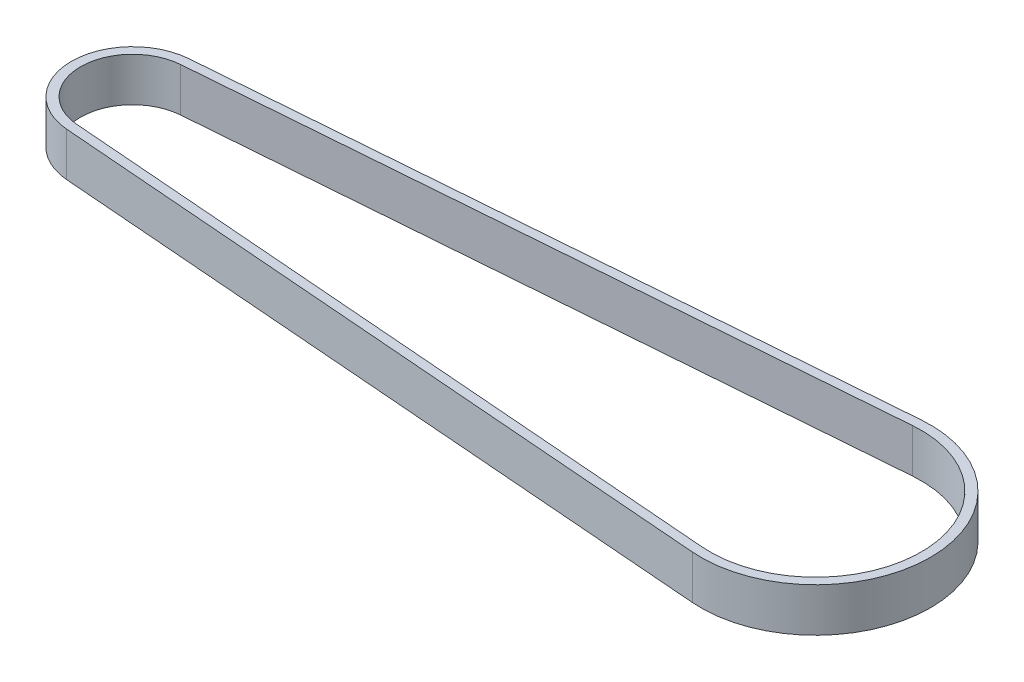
ISO-10303-21;
HEADER;
FILE_DESCRIPTION(('STEP AP214'),'2;1');
FILE_NAME('part.step','',(''),(''),'','','');
FILE_SCHEMA(('AUTOMOTIVE_DESIGN { 1 0 10303 214 1 1 1 1 }'));
ENDSEC;
DATA;
#1=APPLICATION_CONTEXT('core data for automotive mechanical design processes');
#2=APPLICATION_PROTOCOL_DEFINITION('international standard','automotive_design',2000,#1);
#3=PRODUCT_CONTEXT('',#1,'mechanical');
#4=PRODUCT('Part','Part','',(#3));
#5=PRODUCT_RELATED_PRODUCT_CATEGORY('part','',(#4));
#6=PRODUCT_DEFINITION_FORMATION('','',#4);
#7=PRODUCT_DEFINITION_CONTEXT('part definition',#1,'design');
#8=PRODUCT_DEFINITION('design','',#6,#7);
#9=PRODUCT_DEFINITION_SHAPE('','',#8);
#10=(LENGTH_UNIT() NAMED_UNIT(*) SI_UNIT(.MILLI.,.METRE.));
#11=(NAMED_UNIT(*) PLANE_ANGLE_UNIT() SI_UNIT($,.RADIAN.));
#12=(NAMED_UNIT(*) SI_UNIT($,.STERADIAN.) SOLID_ANGLE_UNIT());
#13=UNCERTAINTY_MEASURE_WITH_UNIT(LENGTH_MEASURE(1.E-05),#10,'distance_accuracy_value','');
#14=(GEOMETRIC_REPRESENTATION_CONTEXT(3) GLOBAL_UNCERTAINTY_ASSIGNED_CONTEXT((#13)) GLOBAL_UNIT_ASSIGNED_CONTEXT((#10,
#11,#12)) REPRESENTATION_CONTEXT('',''));
#15=CARTESIAN_POINT('',(0.,0.,0.));
#16=DIRECTION('',(0.,0.,1.));
#17=DIRECTION('',(1.,0.,0.));
#18=AXIS2_PLACEMENT_3D('',#15,#16,#17);
#19=CARTESIAN_POINT('',(0.,15.,0.));
#20=DIRECTION('',(0.,1.,0.));
#21=DIRECTION('',(0.,0.,1.));
#22=AXIS2_PLACEMENT_3D('',#19,#20,#21);
#23=PLANE('',#22);
#24=CARTESIAN_POINT('',(0.,15.,0.));
#25=DIRECTION('',(0.,1.,0.));
#26=DIRECTION('',(0.,0.,1.));
#27=AXIS2_PLACEMENT_3D('',#24,#25,#26);
#28=CIRCLE('',#27,21.0058);
#29=CARTESIAN_POINT('',(-1.64517512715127,15.,-20.9412758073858));
#30=VERTEX_POINT('',#29);
#31=CARTESIAN_POINT('',(-1.64517512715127,15.,20.9412758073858));
#32=VERTEX_POINT('',#31);
#33=EDGE_CURVE('E134',#30,#32,#28,.T.);
#34=ORIENTED_EDGE('',*,*,#33,.T.);
#35=DIRECTION('',(0.996928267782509,0.,0.0783200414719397));
#36=VECTOR('',#35,1.);
#37=CARTESIAN_POINT('',(-1.64517512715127,15.,20.9412758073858));
#38=LINE('',#37,#36);
#39=CARTESIAN_POINT('',(231.139126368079,15.,39.2291273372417));
#40=VERTEX_POINT('',#39);
#41=EDGE_CURVE('E137',#32,#40,#38,.T.);
#42=ORIENTED_EDGE('',*,*,#41,.T.);
#43=CARTESIAN_POINT('',(234.22102,15.,0.));
#44=DIRECTION('',(0.,1.,0.));
#45=DIRECTION('',(0.,0.,1.));
#46=AXIS2_PLACEMENT_3D('',#43,#44,#45);
#47=CIRCLE('',#46,39.35);
#48=CARTESIAN_POINT('',(231.139126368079,15.,-39.2291273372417));
#49=VERTEX_POINT('',#48);
#50=EDGE_CURVE('E140',#40,#49,#47,.T.);
#51=ORIENTED_EDGE('',*,*,#50,.T.);
#52=DIRECTION('',(-0.996928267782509,0.,0.0783200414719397));
#53=VECTOR('',#52,1.);
#54=CARTESIAN_POINT('',(-1.64517512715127,15.,-20.9412758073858));
#55=LINE('',#54,#53);
#56=EDGE_CURVE('E142',#49,#30,#55,.T.);
#57=ORIENTED_EDGE('',*,*,#56,.T.);
#58=EDGE_LOOP('',(#34,#42,#51,#57));
#59=FACE_BOUND('',#58,.T.);
#60=DIRECTION('',(0.996928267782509,0.,0.0783200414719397));
#61=VECTOR('',#60,1.);
#62=CARTESIAN_POINT('',(-1.39650899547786,15.,17.7760285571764));
#63=LINE('',#62,#61);
#64=CARTESIAN_POINT('',(-1.39650899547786,15.,17.7760285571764));
#65=VERTEX_POINT('',#64);
#66=CARTESIAN_POINT('',(231.387792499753,15.,36.0638800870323));
#67=VERTEX_POINT('',#66);
#68=EDGE_CURVE('E106',#65,#67,#63,.T.);
#69=ORIENTED_EDGE('',*,*,#68,.F.);
#70=CARTESIAN_POINT('',(0.,15.,0.));
#71=DIRECTION('',(0.,1.,0.));
#72=DIRECTION('',(0.,0.,1.));
#73=AXIS2_PLACEMENT_3D('',#70,#71,#72);
#74=CIRCLE('',#73,17.8308);
#75=CARTESIAN_POINT('',(-1.39650899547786,15.,-17.7760285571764));
#76=VERTEX_POINT('',#75);
#77=EDGE_CURVE('E98',#76,#65,#74,.T.);
#78=ORIENTED_EDGE('',*,*,#77,.F.);
#79=DIRECTION('',(-0.996928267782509,0.,0.0783200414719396));
#80=VECTOR('',#79,1.);
#81=CARTESIAN_POINT('',(-1.39650899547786,15.,-17.7760285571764));
#82=LINE('',#81,#80);
#83=CARTESIAN_POINT('',(231.387792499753,15.,-36.0638800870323));
#84=VERTEX_POINT('',#83);
#85=EDGE_CURVE('E120',#84,#76,#82,.T.);
#86=ORIENTED_EDGE('',*,*,#85,.F.);
#87=CARTESIAN_POINT('',(234.22102,15.,0.));
#88=DIRECTION('',(0.,1.,0.));
#89=DIRECTION('',(0.,0.,1.));
#90=AXIS2_PLACEMENT_3D('',#87,#88,#89);
#91=CIRCLE('',#90,36.175);
#92=EDGE_CURVE('E118',#67,#84,#91,.T.);
#93=ORIENTED_EDGE('',*,*,#92,.F.);
#94=EDGE_LOOP('',(#69,#78,#86,#93));
#95=FACE_BOUND('',#94,.T.);
#96=ADVANCED_FACE('F33',(#59,#95),#23,.T.);
#97=CARTESIAN_POINT('',(0.,0.,0.));
#98=DIRECTION('',(0.,1.,0.));
#99=DIRECTION('',(0.,0.,1.));
#100=AXIS2_PLACEMENT_3D('',#97,#98,#99);
#101=PLANE('',#100);
#102=CARTESIAN_POINT('',(0.,0.,0.));
#103=DIRECTION('',(0.,1.,0.));
#104=DIRECTION('',(0.,0.,1.));
#105=AXIS2_PLACEMENT_3D('',#102,#103,#104);
#106=CIRCLE('',#105,21.0058);
#107=CARTESIAN_POINT('',(-1.64517512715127,0.,-20.9412758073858));
#108=VERTEX_POINT('',#107);
#109=CARTESIAN_POINT('',(-1.64517512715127,0.,20.9412758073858));
#110=VERTEX_POINT('',#109);
#111=EDGE_CURVE('E114',#108,#110,#106,.T.);
#112=ORIENTED_EDGE('',*,*,#111,.F.);
#113=DIRECTION('',(-0.996928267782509,0.,0.0783200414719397));
#114=VECTOR('',#113,1.);
#115=CARTESIAN_POINT('',(-1.64517512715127,0.,-20.9412758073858));
#116=LINE('',#115,#114);
#117=CARTESIAN_POINT('',(231.139126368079,0.,-39.2291273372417));
#118=VERTEX_POINT('',#117);
#119=EDGE_CURVE('E138',#118,#108,#116,.T.);
#120=ORIENTED_EDGE('',*,*,#119,.F.);
#121=CARTESIAN_POINT('',(234.22102,0.,0.));
#122=DIRECTION('',(0.,1.,0.));
#123=DIRECTION('',(0.,0.,1.));
#124=AXIS2_PLACEMENT_3D('',#121,#122,#123);
#125=CIRCLE('',#124,39.35);
#126=CARTESIAN_POINT('',(231.139126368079,0.,39.2291273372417));
#127=VERTEX_POINT('',#126);
#128=EDGE_CURVE('E149',#127,#118,#125,.T.);
#129=ORIENTED_EDGE('',*,*,#128,.F.);
#130=DIRECTION('',(0.996928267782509,0.,0.0783200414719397));
#131=VECTOR('',#130,1.);
#132=CARTESIAN_POINT('',(-1.64517512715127,0.,20.9412758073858));
#133=LINE('',#132,#131);
#134=EDGE_CURVE('E147',#110,#127,#133,.T.);
#135=ORIENTED_EDGE('',*,*,#134,.F.);
#136=EDGE_LOOP('',(#112,#120,#129,#135));
#137=FACE_BOUND('',#136,.T.);
#138=CARTESIAN_POINT('',(0.,0.,0.));
#139=DIRECTION('',(0.,1.,0.));
#140=DIRECTION('',(0.,0.,1.));
#141=AXIS2_PLACEMENT_3D('',#138,#139,#140);
#142=CIRCLE('',#141,17.8308);
#143=CARTESIAN_POINT('',(-1.39650899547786,0.,-17.7760285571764));
#144=VERTEX_POINT('',#143);
#145=CARTESIAN_POINT('',(-1.39650899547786,0.,17.7760285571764));
#146=VERTEX_POINT('',#145);
#147=EDGE_CURVE('E56',#144,#146,#142,.T.);
#148=ORIENTED_EDGE('',*,*,#147,.T.);
#149=DIRECTION('',(0.996928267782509,0.,0.0783200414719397));
#150=VECTOR('',#149,1.);
#151=CARTESIAN_POINT('',(-1.39650899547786,0.,17.7760285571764));
#152=LINE('',#151,#150);
#153=CARTESIAN_POINT('',(231.387792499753,0.,36.0638800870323));
#154=VERTEX_POINT('',#153);
#155=EDGE_CURVE('E113',#146,#154,#152,.T.);
#156=ORIENTED_EDGE('',*,*,#155,.T.);
#157=CARTESIAN_POINT('',(234.22102,0.,0.));
#158=DIRECTION('',(0.,1.,0.));
#159=DIRECTION('',(0.,0.,1.));
#160=AXIS2_PLACEMENT_3D('',#157,#158,#159);
#161=CIRCLE('',#160,36.175);
#162=CARTESIAN_POINT('',(231.387792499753,0.,-36.0638800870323));
#163=VERTEX_POINT('',#162);
#164=EDGE_CURVE('E126',#154,#163,#161,.T.);
#165=ORIENTED_EDGE('',*,*,#164,.T.);
#166=DIRECTION('',(-0.996928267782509,0.,0.0783200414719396));
#167=VECTOR('',#166,1.);
#168=CARTESIAN_POINT('',(-1.39650899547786,0.,-17.7760285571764));
#169=LINE('',#168,#167);
#170=EDGE_CURVE('E107',#163,#144,#169,.T.);
#171=ORIENTED_EDGE('',*,*,#170,.T.);
#172=EDGE_LOOP('',(#148,#156,#165,#171));
#173=FACE_BOUND('',#172,.T.);
#174=ADVANCED_FACE('F167',(#137,#173),#101,.F.);
#175=CARTESIAN_POINT('',(0.,15.,0.));
#176=DIRECTION('',(0.,-1.,0.));
#177=DIRECTION('',(0.,0.,-1.));
#178=AXIS2_PLACEMENT_3D('',#175,#176,#177);
#179=CYLINDRICAL_SURFACE('',#178,21.0058);
#180=ORIENTED_EDGE('',*,*,#111,.T.);
#181=DIRECTION('',(0.,-1.,0.));
#182=VECTOR('',#181,1.);
#183=CARTESIAN_POINT('',(-1.64517512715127,15.,20.9412758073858));
#184=LINE('',#183,#182);
#185=EDGE_CURVE('E11',#32,#110,#184,.T.);
#186=ORIENTED_EDGE('',*,*,#185,.F.);
#187=ORIENTED_EDGE('',*,*,#33,.F.);
#188=DIRECTION('',(0.,-1.,0.));
#189=VECTOR('',#188,1.);
#190=CARTESIAN_POINT('',(-1.64517512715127,15.,-20.9412758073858));
#191=LINE('',#190,#189);
#192=EDGE_CURVE('E144',#30,#108,#191,.T.);
#193=ORIENTED_EDGE('',*,*,#192,.T.);
#194=EDGE_LOOP('',(#180,#186,#187,#193));
#195=FACE_BOUND('',#194,.T.);
#196=ADVANCED_FACE('F35',(#195),#179,.T.);
#197=CARTESIAN_POINT('',(-1.64517512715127,15.,20.9412758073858));
#198=DIRECTION('',(0.0783200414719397,0.,-0.996928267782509));
#199=DIRECTION('',(-0.996928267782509,0.,-0.0783200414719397));
#200=AXIS2_PLACEMENT_3D('',#197,#198,#199);
#201=PLANE('',#200);
#202=ORIENTED_EDGE('',*,*,#134,.T.);
#203=DIRECTION('',(0.,-1.,0.));
#204=VECTOR('',#203,1.);
#205=CARTESIAN_POINT('',(231.139126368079,15.,39.2291273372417));
#206=LINE('',#205,#204);
#207=EDGE_CURVE('E41',#40,#127,#206,.T.);
#208=ORIENTED_EDGE('',*,*,#207,.F.);
#209=ORIENTED_EDGE('',*,*,#41,.F.);
#210=ORIENTED_EDGE('',*,*,#185,.T.);
#211=EDGE_LOOP('',(#202,#208,#209,#210));
#212=FACE_BOUND('',#211,.T.);
#213=ADVANCED_FACE('F177',(#212),#201,.F.);
#214=CARTESIAN_POINT('',(234.22102,15.,0.));
#215=DIRECTION('',(0.,-1.,0.));
#216=DIRECTION('',(0.,0.,-1.));
#217=AXIS2_PLACEMENT_3D('',#214,#215,#216);
#218=CYLINDRICAL_SURFACE('',#217,39.35);
#219=ORIENTED_EDGE('',*,*,#128,.T.);
#220=DIRECTION('',(0.,-1.,0.));
#221=VECTOR('',#220,1.);
#222=CARTESIAN_POINT('',(231.139126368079,15.,-39.2291273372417));
#223=LINE('',#222,#221);
#224=EDGE_CURVE('E154',#49,#118,#223,.T.);
#225=ORIENTED_EDGE('',*,*,#224,.F.);
#226=ORIENTED_EDGE('',*,*,#50,.F.);
#227=ORIENTED_EDGE('',*,*,#207,.T.);
#228=EDGE_LOOP('',(#219,#225,#226,#227));
#229=FACE_BOUND('',#228,.T.);
#230=ADVANCED_FACE('F161',(#229),#218,.T.);
#231=CARTESIAN_POINT('',(-1.64517512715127,15.,-20.9412758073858));
#232=DIRECTION('',(0.0783200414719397,0.,0.996928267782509));
#233=DIRECTION('',(0.996928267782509,0.,-0.0783200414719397));
#234=AXIS2_PLACEMENT_3D('',#231,#232,#233);
#235=PLANE('',#234);
#236=ORIENTED_EDGE('',*,*,#119,.T.);
#237=ORIENTED_EDGE('',*,*,#192,.F.);
#238=ORIENTED_EDGE('',*,*,#56,.F.);
#239=ORIENTED_EDGE('',*,*,#224,.T.);
#240=EDGE_LOOP('',(#236,#237,#238,#239));
#241=FACE_BOUND('',#240,.T.);
#242=ADVANCED_FACE('F171',(#241),#235,.F.);
#243=CARTESIAN_POINT('',(0.,15.,0.));
#244=DIRECTION('',(0.,-1.,0.));
#245=DIRECTION('',(0.,0.,-1.));
#246=AXIS2_PLACEMENT_3D('',#243,#244,#245);
#247=CYLINDRICAL_SURFACE('',#246,17.8308);
#248=ORIENTED_EDGE('',*,*,#147,.F.);
#249=DIRECTION('',(0.,-1.,0.));
#250=VECTOR('',#249,1.);
#251=CARTESIAN_POINT('',(-1.39650899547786,15.,-17.7760285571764));
#252=LINE('',#251,#250);
#253=EDGE_CURVE('E102',#76,#144,#252,.T.);
#254=ORIENTED_EDGE('',*,*,#253,.F.);
#255=ORIENTED_EDGE('',*,*,#77,.T.);
#256=DIRECTION('',(0.,-1.,0.));
#257=VECTOR('',#256,1.);
#258=CARTESIAN_POINT('',(-1.39650899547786,15.,17.7760285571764));
#259=LINE('',#258,#257);
#260=EDGE_CURVE('E101',#65,#146,#259,.T.);
#261=ORIENTED_EDGE('',*,*,#260,.T.);
#262=EDGE_LOOP('',(#248,#254,#255,#261));
#263=FACE_BOUND('',#262,.T.);
#264=ADVANCED_FACE('F100',(#263),#247,.F.);
#265=CARTESIAN_POINT('',(-1.39650899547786,15.,17.7760285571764));
#266=DIRECTION('',(0.0783200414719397,0.,-0.996928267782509));
#267=DIRECTION('',(-0.996928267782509,0.,-0.0783200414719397));
#268=AXIS2_PLACEMENT_3D('',#265,#266,#267);
#269=PLANE('',#268);
#270=ORIENTED_EDGE('',*,*,#155,.F.);
#271=ORIENTED_EDGE('',*,*,#260,.F.);
#272=ORIENTED_EDGE('',*,*,#68,.T.);
#273=DIRECTION('',(0.,-1.,0.));
#274=VECTOR('',#273,1.);
#275=CARTESIAN_POINT('',(231.387792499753,15.,36.0638800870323));
#276=LINE('',#275,#274);
#277=EDGE_CURVE('E115',#67,#154,#276,.T.);
#278=ORIENTED_EDGE('',*,*,#277,.T.);
#279=EDGE_LOOP('',(#270,#271,#272,#278));
#280=FACE_BOUND('',#279,.T.);
#281=ADVANCED_FACE('F110',(#280),#269,.T.);
#282=CARTESIAN_POINT('',(234.22102,15.,0.));
#283=DIRECTION('',(0.,-1.,0.));
#284=DIRECTION('',(0.,0.,-1.));
#285=AXIS2_PLACEMENT_3D('',#282,#283,#284);
#286=CYLINDRICAL_SURFACE('',#285,36.175);
#287=ORIENTED_EDGE('',*,*,#164,.F.);
#288=ORIENTED_EDGE('',*,*,#277,.F.);
#289=ORIENTED_EDGE('',*,*,#92,.T.);
#290=DIRECTION('',(0.,-1.,0.));
#291=VECTOR('',#290,1.);
#292=CARTESIAN_POINT('',(231.387792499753,15.,-36.0638800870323));
#293=LINE('',#292,#291);
#294=EDGE_CURVE('E48',#84,#163,#293,.T.);
#295=ORIENTED_EDGE('',*,*,#294,.T.);
#296=EDGE_LOOP('',(#287,#288,#289,#295));
#297=FACE_BOUND('',#296,.T.);
#298=ADVANCED_FACE('F200',(#297),#286,.F.);
#299=CARTESIAN_POINT('',(-1.39650899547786,15.,-17.7760285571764));
#300=DIRECTION('',(0.0783200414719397,0.,0.996928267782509));
#301=DIRECTION('',(0.996928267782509,0.,-0.0783200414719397));
#302=AXIS2_PLACEMENT_3D('',#299,#300,#301);
#303=PLANE('',#302);
#304=ORIENTED_EDGE('',*,*,#170,.F.);
#305=ORIENTED_EDGE('',*,*,#294,.F.);
#306=ORIENTED_EDGE('',*,*,#85,.T.);
#307=ORIENTED_EDGE('',*,*,#253,.T.);
#308=EDGE_LOOP('',(#304,#305,#306,#307));
#309=FACE_BOUND('',#308,.T.);
#310=ADVANCED_FACE('F204',(#309),#303,.T.);
#311=CLOSED_SHELL('',(#96,#174,#196,#213,#230,#242,#264,#281,#298,#310));
#312=MANIFOLD_SOLID_BREP('B2',#311);
#313=ADVANCED_BREP_SHAPE_REPRESENTATION('',(#18,#312),#14);
#314=SHAPE_DEFINITION_REPRESENTATION(#9,#313);
ENDSEC;
END-ISO-10303-21;
